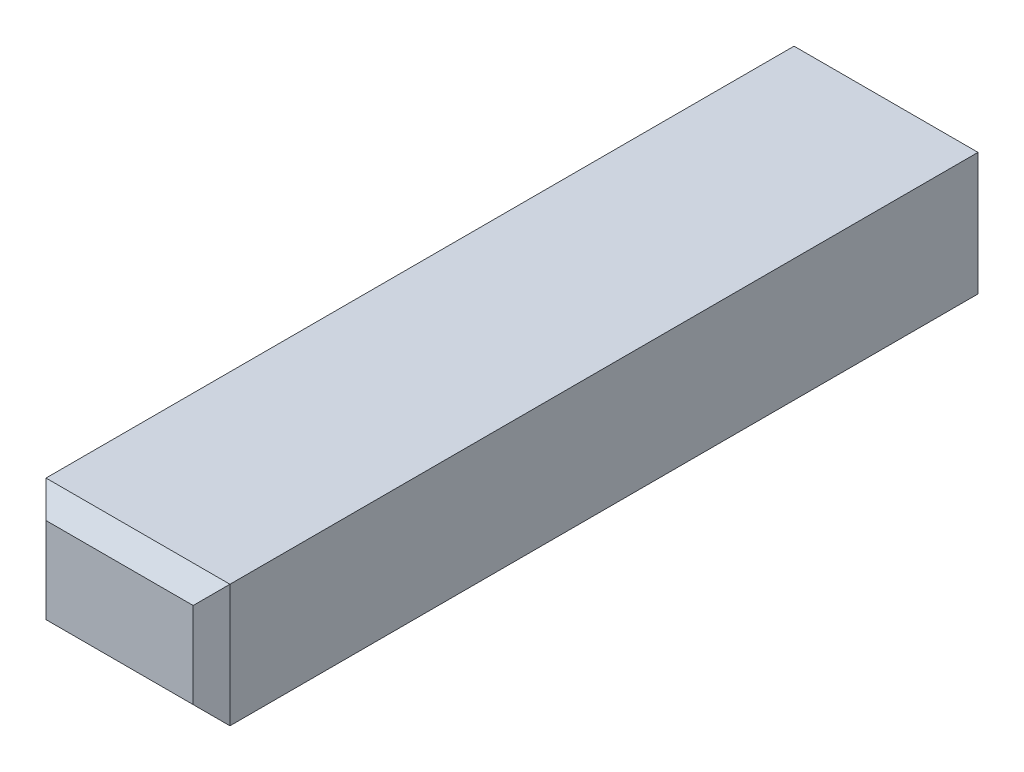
from build123d import *

# Parameters (mm, degrees)
SKETCH1_W           = 12
SKETCH1_H           = 8
BOSS_EXTRUDE1_DEPTH = 25
CHAMFER1_SIZE       = 1.2


with BuildPart() as part:
    # Sketch1 → Boss-Extrude1 (new, symmetric)
    with BuildSketch(Plane.XY):
        Rectangle(SKETCH1_W, SKETCH1_H)
    extrude(amount=BOSS_EXTRUDE1_DEPTH, both=True)

    # Chamfer1
    chamfer1_edges = [part.edges().sort_by_distance(p)[0] for p in [
        (-6, 0, 25),
        (0, -4, 25),
        (6, 0, 25),
        (0, 4, 25),
    ]]
    chamfer(chamfer1_edges, length=CHAMFER1_SIZE)


solid = part.part
